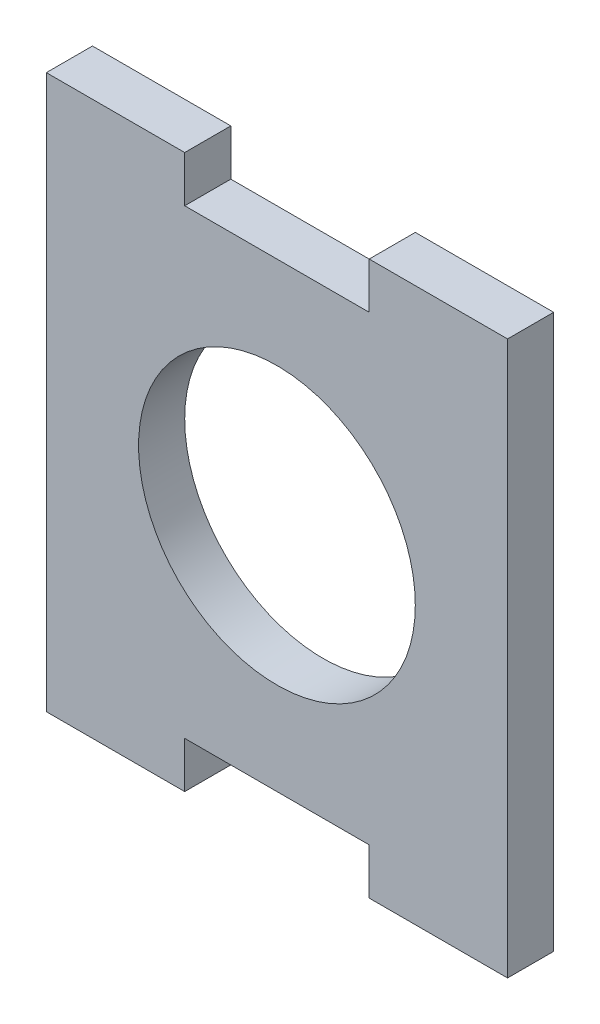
from build123d import *

# Parameters (mm, degrees)
EXTRUSION1_DEPTH        = 1
ESQUISSE2_R             = 3
ENL_V_MAT_EXTRU_1_DEPTH = 1


with BuildPart() as part:
    # Esquisse1 → Extrusion1 (new body)
    with BuildSketch(Plane.XY):
        Polygon((-5, 6), (-2, 6), (-2, 5), (2, 5), (2, 6), (5, 6), (5, -6), (2, -6), (2, -5), (-2, -5), (-2, -6), (-5, -6), align=None)
    extrude(amount=EXTRUSION1_DEPTH)

    # Esquisse2 → Enl_v. mat.-Extru.1 (cut)
    with BuildSketch(Plane.XY.offset(1)):
        Circle(ESQUISSE2_R)
    extrude(amount=-ENL_V_MAT_EXTRU_1_DEPTH, mode=Mode.SUBTRACT)


solid = part.part
